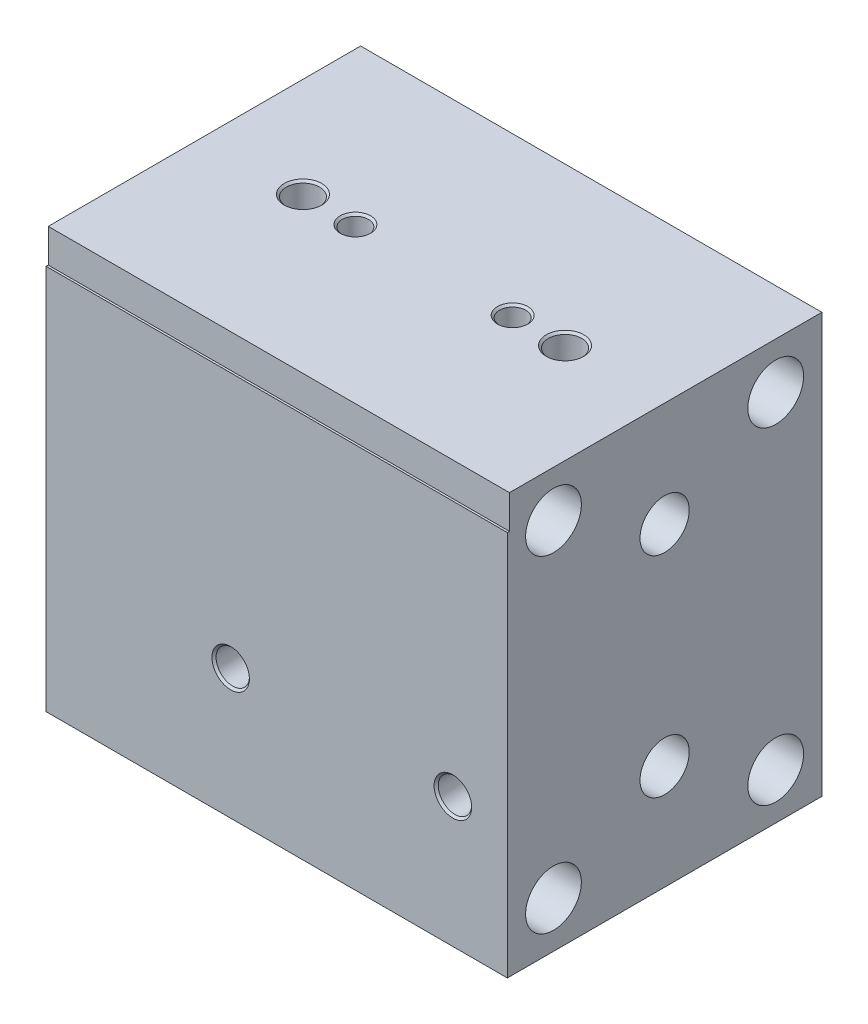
from build123d import *

# Parameters (mm, degrees)
SKETCH1_W                  = 55.88
SKETCH1_H                  = 50.8
EXTRUDE1_DEPTH             = 19.05
SKETCH18_W                 = 0.254
SKETCH18_H                 = 4.064
CUT_EXTRUDE1_DEPTH         = 65.270031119
F_10_32_TAPPED_HOLE2_D     = 4.0386
F_10_32_TAPPED_HOLE2_DEPTH = 13.4874
F_10_32_TAPPED_HOLE2_TIP   = 1.213317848
HOLE1_D                    = 3.175
HOLE1_DEPTH                = 6.35
HOLE1_TIP                  = 0.953866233
F_10_32_TAPPED_HOLE1_D     = 4.0386
F_10_32_TAPPED_HOLE1_DEPTH = 9.5504
F_10_32_TAPPED_HOLE1_TIP   = 1.213317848
F_8_32_TAPPED_HOLE2_D      = 3.4544
F_8_32_TAPPED_HOLE2_DEPTH  = 10.3124
F_8_32_TAPPED_HOLE2_TIP    = 1.037806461
HOLE2_D                    = 3.175
HOLE2_DEPTH                = 6.35
HOLE2_TIP                  = 0.953866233
CHAMFER1_SIZE              = 0.254
SKETCH29_R                 = 3.3782
SKETCH29_R_2               = 2.9845
CUT_EXTRUDE3_DEPTH         = 65.270031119


with BuildPart() as part:
    # Sketch1 → Extrude1 (new, symmetric)
    with BuildSketch(Plane.XY):
        Rectangle(SKETCH1_W, SKETCH1_H)
    extrude(amount=EXTRUDE1_DEPTH, both=True)

    # Sketch18 → Cut-Extrude1 (cut, through all)
    with BuildSketch(Plane(origin=(27.94, 0, 0), x_dir=(0, 0, -1), z_dir=(1, 0, 0))):
        with Locations((-18.923, 23.368)):
            Rectangle(SKETCH18_W, SKETCH18_H)
    extrude(amount=-CUT_EXTRUDE1_DEPTH, mode=Mode.SUBTRACT)

    # 10-32 Tapped Hole2
    with Locations(Plane(origin=(0, 25.4, 0), x_dir=(1, 0, 0), z_dir=(0, 1, 0))):
        with Locations((-15.875, 0), (15.875, 0)):
            Hole(F_10_32_TAPPED_HOLE2_D / 2, depth=F_10_32_TAPPED_HOLE2_DEPTH)
            with Locations((0, 0, -(F_10_32_TAPPED_HOLE2_DEPTH + F_10_32_TAPPED_HOLE2_TIP / 2))):  # 118° drill point
                Cone(0, F_10_32_TAPPED_HOLE2_D / 2, F_10_32_TAPPED_HOLE2_TIP, mode=Mode.SUBTRACT)

    # Hole1
    with Locations(Plane(origin=(0, 25.4, 0), x_dir=(1, 0, 0), z_dir=(0, 1, 0))):
        with Locations((-9.525, 0), (9.525, 0)):
            Hole(HOLE1_D / 2, depth=HOLE1_DEPTH)
            with Locations((0, 0, -(HOLE1_DEPTH + HOLE1_TIP / 2))):  # 118° drill point
                Cone(0, HOLE1_D / 2, HOLE1_TIP, mode=Mode.SUBTRACT)

    # 10-32 Tapped Hole1
    with Locations(Plane.XY.offset(19.05)):
        with Locations((21.336, -9.652), (-5.588, -9.652)):
            Hole(F_10_32_TAPPED_HOLE1_D / 2, depth=F_10_32_TAPPED_HOLE1_DEPTH)
            with Locations((0, 0, -(F_10_32_TAPPED_HOLE1_DEPTH + F_10_32_TAPPED_HOLE1_TIP / 2))):  # 118° drill point
                Cone(0, F_10_32_TAPPED_HOLE1_D / 2, F_10_32_TAPPED_HOLE1_TIP, mode=Mode.SUBTRACT)

    # 8-32 Tapped Hole2
    with Locations(Plane(origin=(0, 0, -19.05), x_dir=(-1, 0, 0), z_dir=(0, 0, -1))):
        with Locations((-9.525, 9.525), (9.525, 9.525), (-9.525, -9.525), (9.525, -9.525)):
            Hole(F_8_32_TAPPED_HOLE2_D / 2, depth=F_8_32_TAPPED_HOLE2_DEPTH)
            with Locations((0, 0, -(F_8_32_TAPPED_HOLE2_DEPTH + F_8_32_TAPPED_HOLE2_TIP / 2))):  # 118° drill point
                Cone(0, F_8_32_TAPPED_HOLE2_D / 2, F_8_32_TAPPED_HOLE2_TIP, mode=Mode.SUBTRACT)

    # Hole2
    with Locations(Plane(origin=(0, 0, -19.05), x_dir=(-1, 0, 0), z_dir=(0, 0, -1))):
        with Locations((0, 9.525), (0, -9.525)):
            Hole(HOLE2_D / 2, depth=HOLE2_DEPTH)
            with Locations((0, 0, -(HOLE2_DEPTH + HOLE2_TIP / 2))):  # 118° drill point
                Cone(0, HOLE2_D / 2, HOLE2_TIP, mode=Mode.SUBTRACT)

    # Chamfer1
    chamfer1_edges = [part.edges().sort_by_distance(p)[0] for p in [
        (17.8943, 25.4, 0),
        (-13.8557, 25.4, 0),
        (11.1125, 25.4, 0),
        (-7.9375, 25.4, 0),
        (-3.5687, -9.652, 19.05),
        (23.3553, -9.652, 19.05),
        (-11.2522, 9.525, -19.05),
        (7.7978, 9.525, -19.05),
        (-1.5875, -9.525, -19.05),
        (-1.5875, 9.525, -19.05),
    ]]
    chamfer(chamfer1_edges, length=CHAMFER1_SIZE)

    # Sketch29 → Cut-Extrude3 (cut, through all)
    with BuildSketch(Plane(origin=(27.94, 0, 0), x_dir=(0, 0, -1), z_dir=(1, 0, 0))):
        with Locations((-13.462, 19.812)):
            Circle(SKETCH29_R)
        with Locations((13.462, 19.812)):
            Circle(SKETCH29_R)
        with Locations((-13.462, -19.812)):
            Circle(SKETCH29_R)
        with Locations((13.462, -19.812)):
            Circle(SKETCH29_R)
        with Locations((0, 12.7)):
            Circle(SKETCH29_R_2)
        with Locations((0, -12.7)):
            Circle(SKETCH29_R_2)
    extrude(amount=-CUT_EXTRUDE3_DEPTH, mode=Mode.SUBTRACT)


solid = part.part
